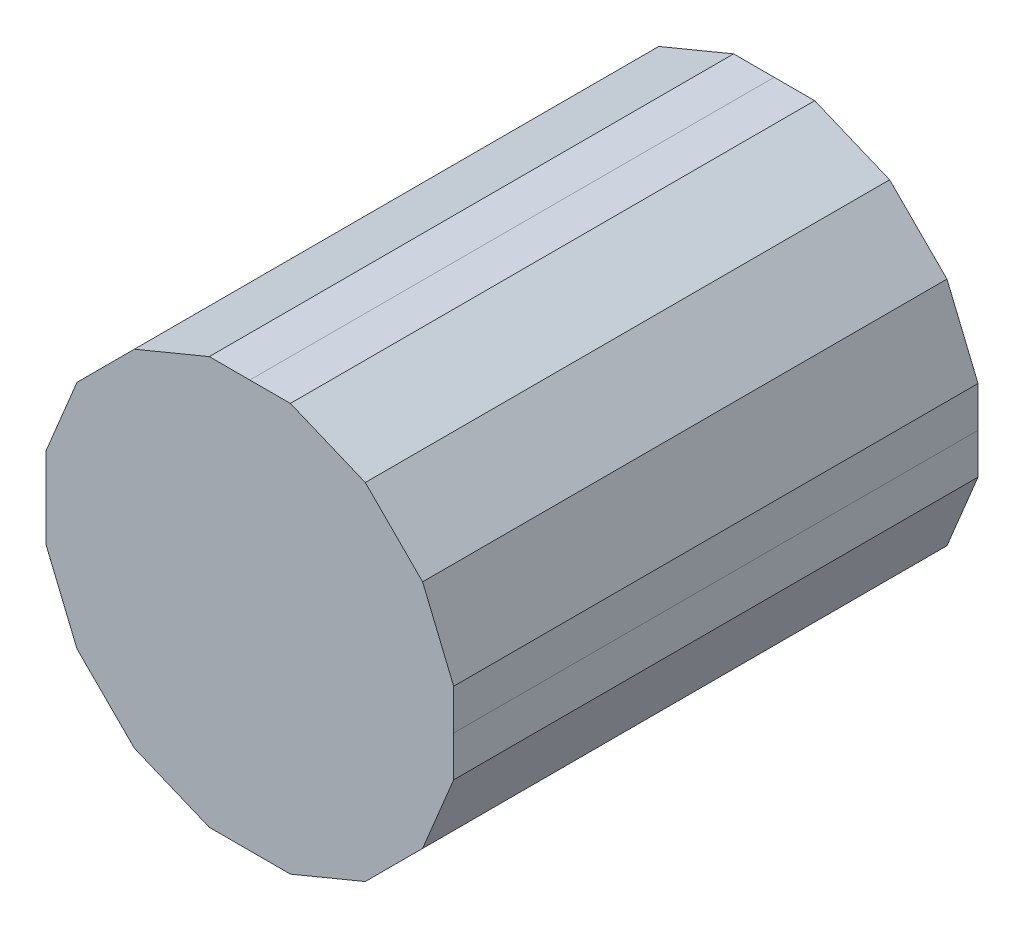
ISO-10303-21;
HEADER;
FILE_DESCRIPTION(('STEP AP214'),'2;1');
FILE_NAME('part.step','',(''),(''),'','','');
FILE_SCHEMA(('AUTOMOTIVE_DESIGN { 1 0 10303 214 1 1 1 1 }'));
ENDSEC;
DATA;
#1=APPLICATION_CONTEXT('core data for automotive mechanical design processes');
#2=APPLICATION_PROTOCOL_DEFINITION('international standard','automotive_design',2000,#1);
#3=PRODUCT_CONTEXT('',#1,'mechanical');
#4=PRODUCT('Part','Part','',(#3));
#5=PRODUCT_RELATED_PRODUCT_CATEGORY('part','',(#4));
#6=PRODUCT_DEFINITION_FORMATION('','',#4);
#7=PRODUCT_DEFINITION_CONTEXT('part definition',#1,'design');
#8=PRODUCT_DEFINITION('design','',#6,#7);
#9=PRODUCT_DEFINITION_SHAPE('','',#8);
#10=(LENGTH_UNIT() NAMED_UNIT(*) SI_UNIT(.MILLI.,.METRE.));
#11=(NAMED_UNIT(*) PLANE_ANGLE_UNIT() SI_UNIT($,.RADIAN.));
#12=(NAMED_UNIT(*) SI_UNIT($,.STERADIAN.) SOLID_ANGLE_UNIT());
#13=UNCERTAINTY_MEASURE_WITH_UNIT(LENGTH_MEASURE(1.E-05),#10,'distance_accuracy_value','');
#14=(GEOMETRIC_REPRESENTATION_CONTEXT(3) GLOBAL_UNCERTAINTY_ASSIGNED_CONTEXT((#13)) GLOBAL_UNIT_ASSIGNED_CONTEXT((#10,
#11,#12)) REPRESENTATION_CONTEXT('',''));
#15=CARTESIAN_POINT('',(0.,0.,0.));
#16=DIRECTION('',(0.,0.,1.));
#17=DIRECTION('',(1.,0.,0.));
#18=AXIS2_PLACEMENT_3D('',#15,#16,#17);
#19=CARTESIAN_POINT('',(-6.703566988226E-07,-6.703566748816E-07,0.21999956));
#20=DIRECTION('',(0.,0.,1.));
#21=DIRECTION('',(1.,0.,0.));
#22=AXIS2_PLACEMENT_3D('',#19,#20,#21);
#23=PLANE('',#22);
#24=DIRECTION('',(0.,-1.,0.));
#25=VECTOR('',#24,1.);
#26=CARTESIAN_POINT('',(-0.08551671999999,0.,0.21999956));
#27=LINE('',#26,#25);
#28=CARTESIAN_POINT('',(-0.08551671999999,0.,0.21999956));
#29=VERTEX_POINT('',#28);
#30=CARTESIAN_POINT('',(-0.08551671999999,-0.01701037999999,0.21999956));
#31=VERTEX_POINT('',#30);
#32=EDGE_CURVE('E413',#29,#31,#27,.T.);
#33=ORIENTED_EDGE('',*,*,#32,.T.);
#34=DIRECTION('',(0.382626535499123,-0.923903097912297,0.));
#35=VECTOR('',#34,1.);
#36=CARTESIAN_POINT('',(-0.08551671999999,-0.01701037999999,0.21999956));
#37=LINE('',#36,#35);
#38=CARTESIAN_POINT('',(-0.07249922,-0.04844287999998,0.21999956));
#39=VERTEX_POINT('',#38);
#40=EDGE_CURVE('E382',#31,#39,#37,.T.);
#41=ORIENTED_EDGE('',*,*,#40,.T.);
#42=DIRECTION('',(0.707106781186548,-0.707106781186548,0.));
#43=VECTOR('',#42,1.);
#44=CARTESIAN_POINT('',(-0.07249922,-0.04844287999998,0.21999956));
#45=LINE('',#44,#43);
#46=CARTESIAN_POINT('',(-0.04844288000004,-0.07249921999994,0.21999956));
#47=VERTEX_POINT('',#46);
#48=EDGE_CURVE('E398',#39,#47,#45,.T.);
#49=ORIENTED_EDGE('',*,*,#48,.T.);
#50=DIRECTION('',(0.923903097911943,-0.382626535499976,0.));
#51=VECTOR('',#50,1.);
#52=CARTESIAN_POINT('',(-0.04844288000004,-0.07249921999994,0.21999956));
#53=LINE('',#52,#51);
#54=CARTESIAN_POINT('',(-0.01701037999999,-0.08551671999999,0.21999956));
#55=VERTEX_POINT('',#54);
#56=EDGE_CURVE('E380',#47,#55,#53,.T.);
#57=ORIENTED_EDGE('',*,*,#56,.T.);
#58=DIRECTION('',(1.,0.,0.));
#59=VECTOR('',#58,1.);
#60=CARTESIAN_POINT('',(-0.01701037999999,-0.08551671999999,0.21999956));
#61=LINE('',#60,#59);
#62=CARTESIAN_POINT('',(0.,-0.08551671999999,0.21999956));
#63=VERTEX_POINT('',#62);
#64=EDGE_CURVE('E217',#55,#63,#61,.T.);
#65=ORIENTED_EDGE('',*,*,#64,.T.);
#66=DIRECTION('',(1.,0.,0.));
#67=VECTOR('',#66,1.);
#68=CARTESIAN_POINT('',(0.,-0.08551671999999,0.21999956));
#69=LINE('',#68,#67);
#70=CARTESIAN_POINT('',(0.01700784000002,-0.08551671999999,0.21999956));
#71=VERTEX_POINT('',#70);
#72=EDGE_CURVE('E214',#63,#71,#69,.T.);
#73=ORIENTED_EDGE('',*,*,#72,.T.);
#74=DIRECTION('',(0.923903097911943,0.382626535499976,0.));
#75=VECTOR('',#74,1.);
#76=CARTESIAN_POINT('',(0.01700784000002,-0.08551671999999,0.21999956));
#77=LINE('',#76,#75);
#78=CARTESIAN_POINT('',(0.04844034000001,-0.07249921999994,0.21999956));
#79=VERTEX_POINT('',#78);
#80=EDGE_CURVE('E199',#71,#79,#77,.T.);
#81=ORIENTED_EDGE('',*,*,#80,.T.);
#82=DIRECTION('',(0.707106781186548,0.707106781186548,0.));
#83=VECTOR('',#82,1.);
#84=CARTESIAN_POINT('',(0.04844034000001,-0.07249921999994,0.21999956));
#85=LINE('',#84,#83);
#86=CARTESIAN_POINT('',(0.07249667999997,-0.04844287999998,0.21999956));
#87=VERTEX_POINT('',#86);
#88=EDGE_CURVE('E264',#79,#87,#85,.T.);
#89=ORIENTED_EDGE('',*,*,#88,.T.);
#90=DIRECTION('',(0.382690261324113,0.923876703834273,0.));
#91=VECTOR('',#90,1.);
#92=CARTESIAN_POINT('',(0.07249667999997,-0.04844287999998,0.21999956));
#93=LINE('',#92,#91);
#94=CARTESIAN_POINT('',(0.08551672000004,-0.01701037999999,0.21999956));
#95=VERTEX_POINT('',#94);
#96=EDGE_CURVE('E249',#87,#95,#93,.T.);
#97=ORIENTED_EDGE('',*,*,#96,.T.);
#98=DIRECTION('',(0.,1.,0.));
#99=VECTOR('',#98,1.);
#100=CARTESIAN_POINT('',(0.08551672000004,-0.01701037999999,0.21999956));
#101=LINE('',#100,#99);
#102=CARTESIAN_POINT('',(0.08551672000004,0.,0.21999956));
#103=VERTEX_POINT('',#102);
#104=EDGE_CURVE('E284',#95,#103,#101,.T.);
#105=ORIENTED_EDGE('',*,*,#104,.T.);
#106=DIRECTION('',(0.,1.,0.));
#107=VECTOR('',#106,1.);
#108=CARTESIAN_POINT('',(0.08551672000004,0.,0.21999956));
#109=LINE('',#108,#107);
#110=CARTESIAN_POINT('',(0.08551672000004,0.01700784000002,0.21999956));
#111=VERTEX_POINT('',#110);
#112=EDGE_CURVE('E293',#103,#111,#109,.T.);
#113=ORIENTED_EDGE('',*,*,#112,.T.);
#114=DIRECTION('',(-0.382690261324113,0.923876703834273,0.));
#115=VECTOR('',#114,1.);
#116=CARTESIAN_POINT('',(0.08551672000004,0.01700784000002,0.21999956));
#117=LINE('',#116,#115);
#118=CARTESIAN_POINT('',(0.07249667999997,0.04844034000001,0.21999956));
#119=VERTEX_POINT('',#118);
#120=EDGE_CURVE('E305',#111,#119,#117,.T.);
#121=ORIENTED_EDGE('',*,*,#120,.T.);
#122=DIRECTION('',(-0.707106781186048,0.707106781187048,0.));
#123=VECTOR('',#122,1.);
#124=CARTESIAN_POINT('',(0.07249667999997,0.04844034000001,0.21999956));
#125=LINE('',#124,#123);
#126=CARTESIAN_POINT('',(0.04844034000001,0.07249668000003,0.21999956));
#127=VERTEX_POINT('',#126);
#128=EDGE_CURVE('E239',#119,#127,#125,.T.);
#129=ORIENTED_EDGE('',*,*,#128,.T.);
#130=DIRECTION('',(-0.923876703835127,0.382690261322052,0.));
#131=VECTOR('',#130,1.);
#132=CARTESIAN_POINT('',(0.04844034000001,0.07249668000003,0.21999956));
#133=LINE('',#132,#131);
#134=CARTESIAN_POINT('',(0.01700784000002,0.08551672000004,0.21999956));
#135=VERTEX_POINT('',#134);
#136=EDGE_CURVE('E320',#127,#135,#133,.T.);
#137=ORIENTED_EDGE('',*,*,#136,.T.);
#138=DIRECTION('',(-1.,0.,0.));
#139=VECTOR('',#138,1.);
#140=CARTESIAN_POINT('',(0.01700784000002,0.08551672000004,0.21999956));
#141=LINE('',#140,#139);
#142=CARTESIAN_POINT('',(0.,0.08551672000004,0.21999956));
#143=VERTEX_POINT('',#142);
#144=EDGE_CURVE('E329',#135,#143,#141,.T.);
#145=ORIENTED_EDGE('',*,*,#144,.T.);
#146=DIRECTION('',(-1.,0.,0.));
#147=VECTOR('',#146,1.);
#148=CARTESIAN_POINT('',(0.,0.08551672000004,0.21999956));
#149=LINE('',#148,#147);
#150=CARTESIAN_POINT('',(-0.01701037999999,0.08551672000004,0.21999956));
#151=VERTEX_POINT('',#150);
#152=EDGE_CURVE('E275',#143,#151,#149,.T.);
#153=ORIENTED_EDGE('',*,*,#152,.T.);
#154=DIRECTION('',(-0.923876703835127,-0.382690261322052,0.));
#155=VECTOR('',#154,1.);
#156=CARTESIAN_POINT('',(-0.01701037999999,0.08551672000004,0.21999956));
#157=LINE('',#156,#155);
#158=CARTESIAN_POINT('',(-0.04844288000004,0.07249668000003,0.21999956));
#159=VERTEX_POINT('',#158);
#160=EDGE_CURVE('E259',#151,#159,#157,.T.);
#161=ORIENTED_EDGE('',*,*,#160,.T.);
#162=DIRECTION('',(-0.707106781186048,-0.707106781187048,0.));
#163=VECTOR('',#162,1.);
#164=CARTESIAN_POINT('',(-0.04844288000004,0.07249668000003,0.21999956));
#165=LINE('',#164,#163);
#166=CARTESIAN_POINT('',(-0.07249922,0.04844034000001,0.21999956));
#167=VERTEX_POINT('',#166);
#168=EDGE_CURVE('E347',#159,#167,#165,.T.);
#169=ORIENTED_EDGE('',*,*,#168,.T.);
#170=DIRECTION('',(-0.382626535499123,-0.923903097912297,0.));
#171=VECTOR('',#170,1.);
#172=CARTESIAN_POINT('',(-0.07249922,0.04844034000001,0.21999956));
#173=LINE('',#172,#171);
#174=CARTESIAN_POINT('',(-0.08551671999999,0.01700784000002,0.21999956));
#175=VERTEX_POINT('',#174);
#176=EDGE_CURVE('E355',#167,#175,#173,.T.);
#177=ORIENTED_EDGE('',*,*,#176,.T.);
#178=DIRECTION('',(0.,-1.,0.));
#179=VECTOR('',#178,1.);
#180=CARTESIAN_POINT('',(-0.08551671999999,0.01700784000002,0.21999956));
#181=LINE('',#180,#179);
#182=EDGE_CURVE('E11',#175,#29,#181,.T.);
#183=ORIENTED_EDGE('',*,*,#182,.T.);
#184=EDGE_LOOP('',(#33,#41,#49,#57,#65,#73,#81,#89,#97,#105,#113,#121,#129,#137,#145,#153,#161,
#169,#177,#183));
#185=FACE_BOUND('',#184,.T.);
#186=ADVANCED_FACE('F17',(#185),#23,.T.);
#187=CARTESIAN_POINT('',(-6.703566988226E-07,-6.703566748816E-07,0.));
#188=DIRECTION('',(0.,0.,1.));
#189=DIRECTION('',(1.,0.,0.));
#190=AXIS2_PLACEMENT_3D('',#187,#188,#189);
#191=PLANE('',#190);
#192=DIRECTION('',(0.,-1.,0.));
#193=VECTOR('',#192,1.);
#194=CARTESIAN_POINT('',(-0.08551671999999,0.01700784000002,0.));
#195=LINE('',#194,#193);
#196=CARTESIAN_POINT('',(-0.08551671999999,0.01700784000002,0.));
#197=VERTEX_POINT('',#196);
#198=CARTESIAN_POINT('',(-0.08551671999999,0.,0.));
#199=VERTEX_POINT('',#198);
#200=EDGE_CURVE('E20',#197,#199,#195,.T.);
#201=ORIENTED_EDGE('',*,*,#200,.F.);
#202=DIRECTION('',(-0.382626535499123,-0.923903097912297,0.));
#203=VECTOR('',#202,1.);
#204=CARTESIAN_POINT('',(-0.07249922,0.04844034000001,0.));
#205=LINE('',#204,#203);
#206=CARTESIAN_POINT('',(-0.07249922,0.04844034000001,0.));
#207=VERTEX_POINT('',#206);
#208=EDGE_CURVE('E351',#207,#197,#205,.T.);
#209=ORIENTED_EDGE('',*,*,#208,.F.);
#210=DIRECTION('',(-0.707106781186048,-0.707106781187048,0.));
#211=VECTOR('',#210,1.);
#212=CARTESIAN_POINT('',(-0.04844288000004,0.07249668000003,0.));
#213=LINE('',#212,#211);
#214=CARTESIAN_POINT('',(-0.04844288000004,0.07249668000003,0.));
#215=VERTEX_POINT('',#214);
#216=EDGE_CURVE('E339',#215,#207,#213,.T.);
#217=ORIENTED_EDGE('',*,*,#216,.F.);
#218=DIRECTION('',(-0.923876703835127,-0.382690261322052,0.));
#219=VECTOR('',#218,1.);
#220=CARTESIAN_POINT('',(-0.01701037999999,0.08551672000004,0.));
#221=LINE('',#220,#219);
#222=CARTESIAN_POINT('',(-0.01701037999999,0.08551672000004,0.));
#223=VERTEX_POINT('',#222);
#224=EDGE_CURVE('E260',#223,#215,#221,.T.);
#225=ORIENTED_EDGE('',*,*,#224,.F.);
#226=DIRECTION('',(-1.,0.,0.));
#227=VECTOR('',#226,1.);
#228=CARTESIAN_POINT('',(0.,0.08551672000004,0.));
#229=LINE('',#228,#227);
#230=CARTESIAN_POINT('',(0.,0.08551672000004,0.));
#231=VERTEX_POINT('',#230);
#232=EDGE_CURVE('E276',#231,#223,#229,.T.);
#233=ORIENTED_EDGE('',*,*,#232,.F.);
#234=DIRECTION('',(-1.,0.,0.));
#235=VECTOR('',#234,1.);
#236=CARTESIAN_POINT('',(0.01700784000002,0.08551672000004,0.));
#237=LINE('',#236,#235);
#238=CARTESIAN_POINT('',(0.01700784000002,0.08551672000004,0.));
#239=VERTEX_POINT('',#238);
#240=EDGE_CURVE('E324',#239,#231,#237,.T.);
#241=ORIENTED_EDGE('',*,*,#240,.F.);
#242=DIRECTION('',(-0.923876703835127,0.382690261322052,0.));
#243=VECTOR('',#242,1.);
#244=CARTESIAN_POINT('',(0.04844034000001,0.07249668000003,0.));
#245=LINE('',#244,#243);
#246=CARTESIAN_POINT('',(0.04844034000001,0.07249668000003,0.));
#247=VERTEX_POINT('',#246);
#248=EDGE_CURVE('E235',#247,#239,#245,.T.);
#249=ORIENTED_EDGE('',*,*,#248,.F.);
#250=DIRECTION('',(-0.707106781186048,0.707106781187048,0.));
#251=VECTOR('',#250,1.);
#252=CARTESIAN_POINT('',(0.07249667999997,0.04844034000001,0.));
#253=LINE('',#252,#251);
#254=CARTESIAN_POINT('',(0.07249667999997,0.04844034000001,0.));
#255=VERTEX_POINT('',#254);
#256=EDGE_CURVE('E309',#255,#247,#253,.T.);
#257=ORIENTED_EDGE('',*,*,#256,.F.);
#258=DIRECTION('',(-0.382690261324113,0.923876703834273,0.));
#259=VECTOR('',#258,1.);
#260=CARTESIAN_POINT('',(0.08551672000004,0.01700784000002,0.));
#261=LINE('',#260,#259);
#262=CARTESIAN_POINT('',(0.08551672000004,0.01700784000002,0.));
#263=VERTEX_POINT('',#262);
#264=EDGE_CURVE('E297',#263,#255,#261,.T.);
#265=ORIENTED_EDGE('',*,*,#264,.F.);
#266=DIRECTION('',(0.,1.,0.));
#267=VECTOR('',#266,1.);
#268=CARTESIAN_POINT('',(0.08551672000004,0.,0.));
#269=LINE('',#268,#267);
#270=CARTESIAN_POINT('',(0.08551672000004,0.,0.));
#271=VERTEX_POINT('',#270);
#272=EDGE_CURVE('E288',#271,#263,#269,.T.);
#273=ORIENTED_EDGE('',*,*,#272,.F.);
#274=DIRECTION('',(0.,1.,0.));
#275=VECTOR('',#274,1.);
#276=CARTESIAN_POINT('',(0.08551672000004,-0.01701037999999,0.));
#277=LINE('',#276,#275);
#278=CARTESIAN_POINT('',(0.08551672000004,-0.01701037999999,0.));
#279=VERTEX_POINT('',#278);
#280=EDGE_CURVE('E270',#279,#271,#277,.T.);
#281=ORIENTED_EDGE('',*,*,#280,.F.);
#282=DIRECTION('',(0.382690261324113,0.923876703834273,0.));
#283=VECTOR('',#282,1.);
#284=CARTESIAN_POINT('',(0.07249667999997,-0.04844287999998,0.));
#285=LINE('',#284,#283);
#286=CARTESIAN_POINT('',(0.07249667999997,-0.04844287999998,0.));
#287=VERTEX_POINT('',#286);
#288=EDGE_CURVE('E250',#287,#279,#285,.T.);
#289=ORIENTED_EDGE('',*,*,#288,.F.);
#290=DIRECTION('',(0.707106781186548,0.707106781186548,0.));
#291=VECTOR('',#290,1.);
#292=CARTESIAN_POINT('',(0.04844034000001,-0.07249921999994,0.));
#293=LINE('',#292,#291);
#294=CARTESIAN_POINT('',(0.04844034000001,-0.07249921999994,0.));
#295=VERTEX_POINT('',#294);
#296=EDGE_CURVE('E211',#295,#287,#293,.T.);
#297=ORIENTED_EDGE('',*,*,#296,.F.);
#298=DIRECTION('',(0.923903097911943,0.382626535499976,0.));
#299=VECTOR('',#298,1.);
#300=CARTESIAN_POINT('',(0.01700784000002,-0.08551671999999,0.));
#301=LINE('',#300,#299);
#302=CARTESIAN_POINT('',(0.01700784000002,-0.08551671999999,0.));
#303=VERTEX_POINT('',#302);
#304=EDGE_CURVE('E222',#303,#295,#301,.T.);
#305=ORIENTED_EDGE('',*,*,#304,.F.);
#306=DIRECTION('',(1.,0.,0.));
#307=VECTOR('',#306,1.);
#308=CARTESIAN_POINT('',(0.,-0.08551671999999,0.));
#309=LINE('',#308,#307);
#310=CARTESIAN_POINT('',(0.,-0.08551671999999,0.));
#311=VERTEX_POINT('',#310);
#312=EDGE_CURVE('E225',#311,#303,#309,.T.);
#313=ORIENTED_EDGE('',*,*,#312,.F.);
#314=DIRECTION('',(1.,0.,0.));
#315=VECTOR('',#314,1.);
#316=CARTESIAN_POINT('',(-0.01701037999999,-0.08551671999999,0.));
#317=LINE('',#316,#315);
#318=CARTESIAN_POINT('',(-0.01701037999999,-0.08551671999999,0.));
#319=VERTEX_POINT('',#318);
#320=EDGE_CURVE('E389',#319,#311,#317,.T.);
#321=ORIENTED_EDGE('',*,*,#320,.F.);
#322=DIRECTION('',(0.923903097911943,-0.382626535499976,0.));
#323=VECTOR('',#322,1.);
#324=CARTESIAN_POINT('',(-0.04844288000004,-0.07249921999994,0.));
#325=LINE('',#324,#323);
#326=CARTESIAN_POINT('',(-0.04844288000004,-0.07249921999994,0.));
#327=VERTEX_POINT('',#326);
#328=EDGE_CURVE('E381',#327,#319,#325,.T.);
#329=ORIENTED_EDGE('',*,*,#328,.F.);
#330=DIRECTION('',(0.707106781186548,-0.707106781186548,0.));
#331=VECTOR('',#330,1.);
#332=CARTESIAN_POINT('',(-0.07249922,-0.04844287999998,0.));
#333=LINE('',#332,#331);
#334=CARTESIAN_POINT('',(-0.07249922,-0.04844287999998,0.));
#335=VERTEX_POINT('',#334);
#336=EDGE_CURVE('E386',#335,#327,#333,.T.);
#337=ORIENTED_EDGE('',*,*,#336,.F.);
#338=DIRECTION('',(0.382626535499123,-0.923903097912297,0.));
#339=VECTOR('',#338,1.);
#340=CARTESIAN_POINT('',(-0.08551671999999,-0.01701037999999,0.));
#341=LINE('',#340,#339);
#342=CARTESIAN_POINT('',(-0.08551671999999,-0.01701037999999,0.));
#343=VERTEX_POINT('',#342);
#344=EDGE_CURVE('E370',#343,#335,#341,.T.);
#345=ORIENTED_EDGE('',*,*,#344,.F.);
#346=DIRECTION('',(0.,-1.,0.));
#347=VECTOR('',#346,1.);
#348=CARTESIAN_POINT('',(-0.08551671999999,0.,0.));
#349=LINE('',#348,#347);
#350=EDGE_CURVE('E815',#199,#343,#349,.T.);
#351=ORIENTED_EDGE('',*,*,#350,.F.);
#352=EDGE_LOOP('',(#201,#209,#217,#225,#233,#241,#249,#257,#265,#273,#281,#289,#297,#305,#313,
#321,#329,#337,#345,#351));
#353=FACE_BOUND('',#352,.T.);
#354=ADVANCED_FACE('F453',(#353),#191,.F.);
#355=CARTESIAN_POINT('',(-0.08551671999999,0.01700784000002,0.));
#356=DIRECTION('',(1.,0.,0.));
#357=DIRECTION('',(0.,1.,0.));
#358=AXIS2_PLACEMENT_3D('',#355,#356,#357);
#359=PLANE('',#358);
#360=ORIENTED_EDGE('',*,*,#200,.T.);
#361=DIRECTION('',(0.,0.,1.));
#362=VECTOR('',#361,1.);
#363=CARTESIAN_POINT('',(-0.08551671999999,0.,0.));
#364=LINE('',#363,#362);
#365=EDGE_CURVE('E375',#199,#29,#364,.T.);
#366=ORIENTED_EDGE('',*,*,#365,.T.);
#367=ORIENTED_EDGE('',*,*,#182,.F.);
#368=DIRECTION('',(0.,0.,1.));
#369=VECTOR('',#368,1.);
#370=CARTESIAN_POINT('',(-0.08551671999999,0.01700784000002,0.));
#371=LINE('',#370,#369);
#372=EDGE_CURVE('E354',#197,#175,#371,.T.);
#373=ORIENTED_EDGE('',*,*,#372,.F.);
#374=EDGE_LOOP('',(#360,#366,#367,#373));
#375=FACE_BOUND('',#374,.T.);
#376=ADVANCED_FACE('F472',(#375),#359,.F.);
#377=CARTESIAN_POINT('',(-0.07249922,0.04844034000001,0.));
#378=DIRECTION('',(0.923903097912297,-0.382626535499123,0.));
#379=DIRECTION('',(0.,0.,-1.));
#380=AXIS2_PLACEMENT_3D('',#377,#378,#379);
#381=PLANE('',#380);
#382=ORIENTED_EDGE('',*,*,#208,.T.);
#383=ORIENTED_EDGE('',*,*,#372,.T.);
#384=ORIENTED_EDGE('',*,*,#176,.F.);
#385=DIRECTION('',(0.,0.,1.));
#386=VECTOR('',#385,1.);
#387=CARTESIAN_POINT('',(-0.07249922,0.04844034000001,0.));
#388=LINE('',#387,#386);
#389=EDGE_CURVE('E343',#207,#167,#388,.T.);
#390=ORIENTED_EDGE('',*,*,#389,.F.);
#391=EDGE_LOOP('',(#382,#383,#384,#390));
#392=FACE_BOUND('',#391,.T.);
#393=ADVANCED_FACE('F470',(#392),#381,.F.);
#394=CARTESIAN_POINT('',(-0.04844288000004,0.07249668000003,0.));
#395=DIRECTION('',(0.707106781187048,-0.707106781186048,0.));
#396=DIRECTION('',(0.,0.,-1.));
#397=AXIS2_PLACEMENT_3D('',#394,#395,#396);
#398=PLANE('',#397);
#399=ORIENTED_EDGE('',*,*,#216,.T.);
#400=ORIENTED_EDGE('',*,*,#389,.T.);
#401=ORIENTED_EDGE('',*,*,#168,.F.);
#402=DIRECTION('',(0.,0.,1.));
#403=VECTOR('',#402,1.);
#404=CARTESIAN_POINT('',(-0.04844288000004,0.07249668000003,0.));
#405=LINE('',#404,#403);
#406=EDGE_CURVE('E255',#215,#159,#405,.T.);
#407=ORIENTED_EDGE('',*,*,#406,.F.);
#408=EDGE_LOOP('',(#399,#400,#401,#407));
#409=FACE_BOUND('',#408,.T.);
#410=ADVANCED_FACE('F468',(#409),#398,.F.);
#411=CARTESIAN_POINT('',(-0.01701037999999,0.08551672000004,0.));
#412=DIRECTION('',(0.382690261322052,-0.923876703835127,0.));
#413=DIRECTION('',(0.,0.,-1.));
#414=AXIS2_PLACEMENT_3D('',#411,#412,#413);
#415=PLANE('',#414);
#416=ORIENTED_EDGE('',*,*,#224,.T.);
#417=ORIENTED_EDGE('',*,*,#406,.T.);
#418=ORIENTED_EDGE('',*,*,#160,.F.);
#419=DIRECTION('',(0.,0.,1.));
#420=VECTOR('',#419,1.);
#421=CARTESIAN_POINT('',(-0.01701037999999,0.08551672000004,0.));
#422=LINE('',#421,#420);
#423=EDGE_CURVE('E271',#223,#151,#422,.T.);
#424=ORIENTED_EDGE('',*,*,#423,.F.);
#425=EDGE_LOOP('',(#416,#417,#418,#424));
#426=FACE_BOUND('',#425,.T.);
#427=ADVANCED_FACE('F465',(#426),#415,.F.);
#428=CARTESIAN_POINT('',(0.,0.08551672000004,0.));
#429=DIRECTION('',(0.,-1.,0.));
#430=DIRECTION('',(0.,0.,-1.));
#431=AXIS2_PLACEMENT_3D('',#428,#429,#430);
#432=PLANE('',#431);
#433=ORIENTED_EDGE('',*,*,#232,.T.);
#434=ORIENTED_EDGE('',*,*,#423,.T.);
#435=ORIENTED_EDGE('',*,*,#152,.F.);
#436=DIRECTION('',(0.,0.,1.));
#437=VECTOR('',#436,1.);
#438=CARTESIAN_POINT('',(0.,0.08551672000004,0.));
#439=LINE('',#438,#437);
#440=EDGE_CURVE('E325',#231,#143,#439,.T.);
#441=ORIENTED_EDGE('',*,*,#440,.F.);
#442=EDGE_LOOP('',(#433,#434,#435,#441));
#443=FACE_BOUND('',#442,.T.);
#444=ADVANCED_FACE('F463',(#443),#432,.F.);
#445=CARTESIAN_POINT('',(0.01700784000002,0.08551672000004,0.));
#446=DIRECTION('',(0.,-1.,0.));
#447=DIRECTION('',(0.,0.,-1.));
#448=AXIS2_PLACEMENT_3D('',#445,#446,#447);
#449=PLANE('',#448);
#450=ORIENTED_EDGE('',*,*,#240,.T.);
#451=ORIENTED_EDGE('',*,*,#440,.T.);
#452=ORIENTED_EDGE('',*,*,#144,.F.);
#453=DIRECTION('',(0.,0.,1.));
#454=VECTOR('',#453,1.);
#455=CARTESIAN_POINT('',(0.01700784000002,0.08551672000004,0.));
#456=LINE('',#455,#454);
#457=EDGE_CURVE('E238',#239,#135,#456,.T.);
#458=ORIENTED_EDGE('',*,*,#457,.F.);
#459=EDGE_LOOP('',(#450,#451,#452,#458));
#460=FACE_BOUND('',#459,.T.);
#461=ADVANCED_FACE('F457',(#460),#449,.F.);
#462=CARTESIAN_POINT('',(0.04844034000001,0.07249668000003,0.));
#463=DIRECTION('',(-0.382690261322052,-0.923876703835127,0.));
#464=DIRECTION('',(-0.923876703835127,0.382690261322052,0.));
#465=AXIS2_PLACEMENT_3D('',#462,#463,#464);
#466=PLANE('',#465);
#467=ORIENTED_EDGE('',*,*,#248,.T.);
#468=ORIENTED_EDGE('',*,*,#457,.T.);
#469=ORIENTED_EDGE('',*,*,#136,.F.);
#470=DIRECTION('',(0.,0.,1.));
#471=VECTOR('',#470,1.);
#472=CARTESIAN_POINT('',(0.04844034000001,0.07249668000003,0.));
#473=LINE('',#472,#471);
#474=EDGE_CURVE('E313',#247,#127,#473,.T.);
#475=ORIENTED_EDGE('',*,*,#474,.F.);
#476=EDGE_LOOP('',(#467,#468,#469,#475));
#477=FACE_BOUND('',#476,.T.);
#478=ADVANCED_FACE('F447',(#477),#466,.F.);
#479=CARTESIAN_POINT('',(0.07249667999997,0.04844034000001,0.));
#480=DIRECTION('',(-0.707106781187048,-0.707106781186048,0.));
#481=DIRECTION('',(-0.707106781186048,0.707106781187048,0.));
#482=AXIS2_PLACEMENT_3D('',#479,#480,#481);
#483=PLANE('',#482);
#484=ORIENTED_EDGE('',*,*,#256,.T.);
#485=ORIENTED_EDGE('',*,*,#474,.T.);
#486=ORIENTED_EDGE('',*,*,#128,.F.);
#487=DIRECTION('',(0.,0.,1.));
#488=VECTOR('',#487,1.);
#489=CARTESIAN_POINT('',(0.07249667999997,0.04844034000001,0.));
#490=LINE('',#489,#488);
#491=EDGE_CURVE('E301',#255,#119,#490,.T.);
#492=ORIENTED_EDGE('',*,*,#491,.F.);
#493=EDGE_LOOP('',(#484,#485,#486,#492));
#494=FACE_BOUND('',#493,.T.);
#495=ADVANCED_FACE('F444',(#494),#483,.F.);
#496=CARTESIAN_POINT('',(0.08551672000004,0.01700784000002,0.));
#497=DIRECTION('',(-0.923876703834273,-0.382690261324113,0.));
#498=DIRECTION('',(-0.382690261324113,0.923876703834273,0.));
#499=AXIS2_PLACEMENT_3D('',#496,#497,#498);
#500=PLANE('',#499);
#501=ORIENTED_EDGE('',*,*,#264,.T.);
#502=ORIENTED_EDGE('',*,*,#491,.T.);
#503=ORIENTED_EDGE('',*,*,#120,.F.);
#504=DIRECTION('',(0.,0.,1.));
#505=VECTOR('',#504,1.);
#506=CARTESIAN_POINT('',(0.08551672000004,0.01700784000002,0.));
#507=LINE('',#506,#505);
#508=EDGE_CURVE('E292',#263,#111,#507,.T.);
#509=ORIENTED_EDGE('',*,*,#508,.F.);
#510=EDGE_LOOP('',(#501,#502,#503,#509));
#511=FACE_BOUND('',#510,.T.);
#512=ADVANCED_FACE('F452',(#511),#500,.F.);
#513=CARTESIAN_POINT('',(0.08551672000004,0.,0.));
#514=DIRECTION('',(-1.,0.,0.));
#515=DIRECTION('',(0.,0.,1.));
#516=AXIS2_PLACEMENT_3D('',#513,#514,#515);
#517=PLANE('',#516);
#518=ORIENTED_EDGE('',*,*,#272,.T.);
#519=ORIENTED_EDGE('',*,*,#508,.T.);
#520=ORIENTED_EDGE('',*,*,#112,.F.);
#521=DIRECTION('',(0.,0.,1.));
#522=VECTOR('',#521,1.);
#523=CARTESIAN_POINT('',(0.08551672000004,0.,0.));
#524=LINE('',#523,#522);
#525=EDGE_CURVE('E280',#271,#103,#524,.T.);
#526=ORIENTED_EDGE('',*,*,#525,.F.);
#527=EDGE_LOOP('',(#518,#519,#520,#526));
#528=FACE_BOUND('',#527,.T.);
#529=ADVANCED_FACE('F550',(#528),#517,.F.);
#530=CARTESIAN_POINT('',(0.08551672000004,-0.01701037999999,0.));
#531=DIRECTION('',(-1.,0.,0.));
#532=DIRECTION('',(0.,0.,1.));
#533=AXIS2_PLACEMENT_3D('',#530,#531,#532);
#534=PLANE('',#533);
#535=ORIENTED_EDGE('',*,*,#280,.T.);
#536=ORIENTED_EDGE('',*,*,#525,.T.);
#537=ORIENTED_EDGE('',*,*,#104,.F.);
#538=DIRECTION('',(0.,0.,1.));
#539=VECTOR('',#538,1.);
#540=CARTESIAN_POINT('',(0.08551672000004,-0.01701037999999,0.));
#541=LINE('',#540,#539);
#542=EDGE_CURVE('E245',#279,#95,#541,.T.);
#543=ORIENTED_EDGE('',*,*,#542,.F.);
#544=EDGE_LOOP('',(#535,#536,#537,#543));
#545=FACE_BOUND('',#544,.T.);
#546=ADVANCED_FACE('F555',(#545),#534,.F.);
#547=CARTESIAN_POINT('',(0.07249667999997,-0.04844287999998,0.));
#548=DIRECTION('',(-0.923876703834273,0.382690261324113,0.));
#549=DIRECTION('',(0.,0.,1.));
#550=AXIS2_PLACEMENT_3D('',#547,#548,#549);
#551=PLANE('',#550);
#552=ORIENTED_EDGE('',*,*,#288,.T.);
#553=ORIENTED_EDGE('',*,*,#542,.T.);
#554=ORIENTED_EDGE('',*,*,#96,.F.);
#555=DIRECTION('',(0.,0.,1.));
#556=VECTOR('',#555,1.);
#557=CARTESIAN_POINT('',(0.07249667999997,-0.04844287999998,0.));
#558=LINE('',#557,#556);
#559=EDGE_CURVE('E254',#287,#87,#558,.T.);
#560=ORIENTED_EDGE('',*,*,#559,.F.);
#561=EDGE_LOOP('',(#552,#553,#554,#560));
#562=FACE_BOUND('',#561,.T.);
#563=ADVANCED_FACE('F561',(#562),#551,.F.);
#564=CARTESIAN_POINT('',(0.04844034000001,-0.07249921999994,0.));
#565=DIRECTION('',(-0.707106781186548,0.707106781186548,0.));
#566=DIRECTION('',(0.,0.,1.));
#567=AXIS2_PLACEMENT_3D('',#564,#565,#566);
#568=PLANE('',#567);
#569=ORIENTED_EDGE('',*,*,#296,.T.);
#570=ORIENTED_EDGE('',*,*,#559,.T.);
#571=ORIENTED_EDGE('',*,*,#88,.F.);
#572=DIRECTION('',(0.,0.,1.));
#573=VECTOR('',#572,1.);
#574=CARTESIAN_POINT('',(0.04844034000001,-0.07249921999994,0.));
#575=LINE('',#574,#573);
#576=EDGE_CURVE('E207',#295,#79,#575,.T.);
#577=ORIENTED_EDGE('',*,*,#576,.F.);
#578=EDGE_LOOP('',(#569,#570,#571,#577));
#579=FACE_BOUND('',#578,.T.);
#580=ADVANCED_FACE('F566',(#579),#568,.F.);
#581=CARTESIAN_POINT('',(0.01700784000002,-0.08551671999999,0.));
#582=DIRECTION('',(-0.382626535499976,0.923903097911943,0.));
#583=DIRECTION('',(0.,0.,1.));
#584=AXIS2_PLACEMENT_3D('',#581,#582,#583);
#585=PLANE('',#584);
#586=ORIENTED_EDGE('',*,*,#304,.T.);
#587=ORIENTED_EDGE('',*,*,#576,.T.);
#588=ORIENTED_EDGE('',*,*,#80,.F.);
#589=DIRECTION('',(0.,0.,1.));
#590=VECTOR('',#589,1.);
#591=CARTESIAN_POINT('',(0.01700784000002,-0.08551671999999,0.));
#592=LINE('',#591,#590);
#593=EDGE_CURVE('E204',#303,#71,#592,.T.);
#594=ORIENTED_EDGE('',*,*,#593,.F.);
#595=EDGE_LOOP('',(#586,#587,#588,#594));
#596=FACE_BOUND('',#595,.T.);
#597=ADVANCED_FACE('F202',(#596),#585,.F.);
#598=CARTESIAN_POINT('',(0.,-0.08551671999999,0.));
#599=DIRECTION('',(0.,1.,0.));
#600=DIRECTION('',(1.,0.,0.));
#601=AXIS2_PLACEMENT_3D('',#598,#599,#600);
#602=PLANE('',#601);
#603=ORIENTED_EDGE('',*,*,#312,.T.);
#604=ORIENTED_EDGE('',*,*,#593,.T.);
#605=ORIENTED_EDGE('',*,*,#72,.F.);
#606=DIRECTION('',(0.,0.,1.));
#607=VECTOR('',#606,1.);
#608=CARTESIAN_POINT('',(0.,-0.08551671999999,0.));
#609=LINE('',#608,#607);
#610=EDGE_CURVE('E368',#311,#63,#609,.T.);
#611=ORIENTED_EDGE('',*,*,#610,.F.);
#612=EDGE_LOOP('',(#603,#604,#605,#611));
#613=FACE_BOUND('',#612,.T.);
#614=ADVANCED_FACE('F224',(#613),#602,.F.);
#615=CARTESIAN_POINT('',(-0.01701037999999,-0.08551671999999,0.));
#616=DIRECTION('',(0.,1.,0.));
#617=DIRECTION('',(1.,0.,0.));
#618=AXIS2_PLACEMENT_3D('',#615,#616,#617);
#619=PLANE('',#618);
#620=ORIENTED_EDGE('',*,*,#320,.T.);
#621=ORIENTED_EDGE('',*,*,#610,.T.);
#622=ORIENTED_EDGE('',*,*,#64,.F.);
#623=DIRECTION('',(0.,0.,1.));
#624=VECTOR('',#623,1.);
#625=CARTESIAN_POINT('',(-0.01701037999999,-0.08551671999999,0.));
#626=LINE('',#625,#624);
#627=EDGE_CURVE('E376',#319,#55,#626,.T.);
#628=ORIENTED_EDGE('',*,*,#627,.F.);
#629=EDGE_LOOP('',(#620,#621,#622,#628));
#630=FACE_BOUND('',#629,.T.);
#631=ADVANCED_FACE('F596',(#630),#619,.F.);
#632=CARTESIAN_POINT('',(-0.04844288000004,-0.07249921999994,0.));
#633=DIRECTION('',(0.382626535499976,0.923903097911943,0.));
#634=DIRECTION('',(0.,0.,-1.));
#635=AXIS2_PLACEMENT_3D('',#632,#633,#634);
#636=PLANE('',#635);
#637=ORIENTED_EDGE('',*,*,#328,.T.);
#638=ORIENTED_EDGE('',*,*,#627,.T.);
#639=ORIENTED_EDGE('',*,*,#56,.F.);
#640=DIRECTION('',(0.,0.,1.));
#641=VECTOR('',#640,1.);
#642=CARTESIAN_POINT('',(-0.04844288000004,-0.07249921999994,0.));
#643=LINE('',#642,#641);
#644=EDGE_CURVE('E393',#327,#47,#643,.T.);
#645=ORIENTED_EDGE('',*,*,#644,.F.);
#646=EDGE_LOOP('',(#637,#638,#639,#645));
#647=FACE_BOUND('',#646,.T.);
#648=ADVANCED_FACE('F607',(#647),#636,.F.);
#649=CARTESIAN_POINT('',(-0.07249922,-0.04844287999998,0.));
#650=DIRECTION('',(0.707106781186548,0.707106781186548,0.));
#651=DIRECTION('',(0.,0.,-1.));
#652=AXIS2_PLACEMENT_3D('',#649,#650,#651);
#653=PLANE('',#652);
#654=ORIENTED_EDGE('',*,*,#336,.T.);
#655=ORIENTED_EDGE('',*,*,#644,.T.);
#656=ORIENTED_EDGE('',*,*,#48,.F.);
#657=DIRECTION('',(0.,0.,1.));
#658=VECTOR('',#657,1.);
#659=CARTESIAN_POINT('',(-0.07249922,-0.04844287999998,0.));
#660=LINE('',#659,#658);
#661=EDGE_CURVE('E374',#335,#39,#660,.T.);
#662=ORIENTED_EDGE('',*,*,#661,.F.);
#663=EDGE_LOOP('',(#654,#655,#656,#662));
#664=FACE_BOUND('',#663,.T.);
#665=ADVANCED_FACE('F601',(#664),#653,.F.);
#666=CARTESIAN_POINT('',(-0.08551671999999,-0.01701037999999,0.));
#667=DIRECTION('',(0.923903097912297,0.382626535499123,0.));
#668=DIRECTION('',(0.,0.,-1.));
#669=AXIS2_PLACEMENT_3D('',#666,#667,#668);
#670=PLANE('',#669);
#671=ORIENTED_EDGE('',*,*,#344,.T.);
#672=ORIENTED_EDGE('',*,*,#661,.T.);
#673=ORIENTED_EDGE('',*,*,#40,.F.);
#674=DIRECTION('',(0.,0.,1.));
#675=VECTOR('',#674,1.);
#676=CARTESIAN_POINT('',(-0.08551671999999,-0.01701037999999,0.));
#677=LINE('',#676,#675);
#678=EDGE_CURVE('E430',#343,#31,#677,.T.);
#679=ORIENTED_EDGE('',*,*,#678,.F.);
#680=EDGE_LOOP('',(#671,#672,#673,#679));
#681=FACE_BOUND('',#680,.T.);
#682=ADVANCED_FACE('F606',(#681),#670,.F.);
#683=CARTESIAN_POINT('',(-0.08551671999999,0.,0.));
#684=DIRECTION('',(1.,0.,0.));
#685=DIRECTION('',(0.,1.,0.));
#686=AXIS2_PLACEMENT_3D('',#683,#684,#685);
#687=PLANE('',#686);
#688=ORIENTED_EDGE('',*,*,#350,.T.);
#689=ORIENTED_EDGE('',*,*,#678,.T.);
#690=ORIENTED_EDGE('',*,*,#32,.F.);
#691=ORIENTED_EDGE('',*,*,#365,.F.);
#692=EDGE_LOOP('',(#688,#689,#690,#691));
#693=FACE_BOUND('',#692,.T.);
#694=ADVANCED_FACE('F616',(#693),#687,.F.);
#695=CLOSED_SHELL('',(#186,#354,#376,#393,#410,#427,#444,#461,#478,#495,#512,#529,#546,#563,
#580,#597,#614,#631,#648,#665,#682,#694));
#696=MANIFOLD_SOLID_BREP('B1',#695);
#697=ADVANCED_BREP_SHAPE_REPRESENTATION('',(#18,#696),#14);
#698=SHAPE_DEFINITION_REPRESENTATION(#9,#697);
ENDSEC;
END-ISO-10303-21;
